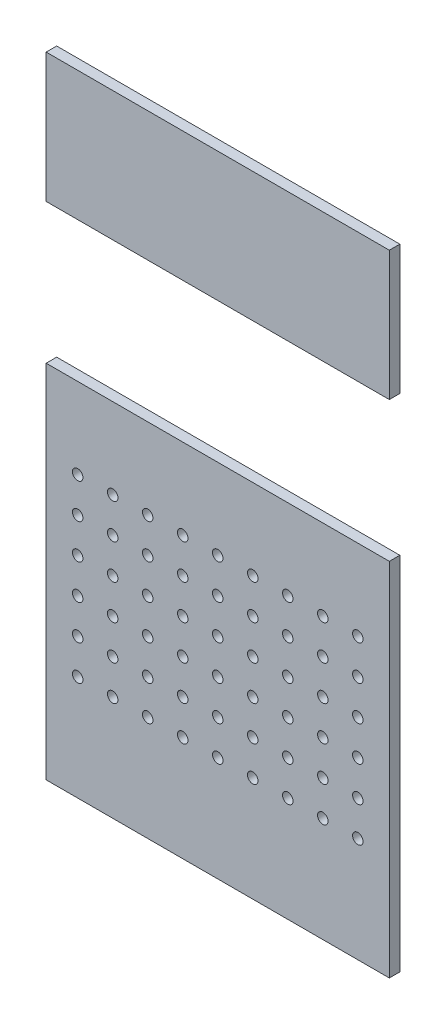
from build123d import *

# Parameters (mm, degrees)
CROQUIS1_W                = 98
CROQUIS1_H                = 103.054416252
CROQUIS1_R                = 1.5
SALIENTE_EXTRUIR2_DEPTH   = 3
CROQUIS1_H_2              = 36.945583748
SALIENTE_EXTRUIR2_2_DEPTH = 3


with BuildPart() as part:
    # Croquis1 → Saliente-Extruir2 (new body)
    with BuildSketch(Plane.XY):
        with Locations((25.551303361, -22.939606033)):
            Rectangle(CROQUIS1_W, CROQUIS1_H)
        with Locations((-14.448696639, -24.466814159)):
            Circle(CROQUIS1_R, mode=Mode.SUBTRACT)
        with Locations((-4.448696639, -24.466814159)):
            Circle(CROQUIS1_R, mode=Mode.SUBTRACT)
        with Locations((5.551303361, -24.466814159)):
            Circle(CROQUIS1_R, mode=Mode.SUBTRACT)
        with Locations((15.551303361, -24.466814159)):
            Circle(CROQUIS1_R, mode=Mode.SUBTRACT)
        with Locations((25.551303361, -24.466814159)):
            Circle(CROQUIS1_R, mode=Mode.SUBTRACT)
        with Locations((35.551303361, -24.466814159)):
            Circle(CROQUIS1_R, mode=Mode.SUBTRACT)
        with Locations((45.551303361, -24.466814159)):
            Circle(CROQUIS1_R, mode=Mode.SUBTRACT)
        with Locations((55.551303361, -24.466814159)):
            Circle(CROQUIS1_R, mode=Mode.SUBTRACT)
        with Locations((65.551303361, -24.466814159)):
            Circle(CROQUIS1_R, mode=Mode.SUBTRACT)
        with Locations((-4.448696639, -34.466814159)):
            Circle(CROQUIS1_R, mode=Mode.SUBTRACT)
        with Locations((5.551303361, -34.466814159)):
            Circle(CROQUIS1_R, mode=Mode.SUBTRACT)
        with Locations((15.551303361, -34.466814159)):
            Circle(CROQUIS1_R, mode=Mode.SUBTRACT)
        with Locations((25.551303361, -34.466814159)):
            Circle(CROQUIS1_R, mode=Mode.SUBTRACT)
        with Locations((35.551303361, -34.466814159)):
            Circle(CROQUIS1_R, mode=Mode.SUBTRACT)
        with Locations((45.551303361, -34.466814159)):
            Circle(CROQUIS1_R, mode=Mode.SUBTRACT)
        with Locations((55.551303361, -34.466814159)):
            Circle(CROQUIS1_R, mode=Mode.SUBTRACT)
        with Locations((65.551303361, -34.466814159)):
            Circle(CROQUIS1_R, mode=Mode.SUBTRACT)
        with Locations((-4.448696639, -44.466814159)):
            Circle(CROQUIS1_R, mode=Mode.SUBTRACT)
        with Locations((5.551303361, -44.466814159)):
            Circle(CROQUIS1_R, mode=Mode.SUBTRACT)
        with Locations((15.551303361, -44.466814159)):
            Circle(CROQUIS1_R, mode=Mode.SUBTRACT)
        with Locations((25.551303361, -44.466814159)):
            Circle(CROQUIS1_R, mode=Mode.SUBTRACT)
        with Locations((35.551303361, -44.466814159)):
            Circle(CROQUIS1_R, mode=Mode.SUBTRACT)
        with Locations((45.551303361, -44.466814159)):
            Circle(CROQUIS1_R, mode=Mode.SUBTRACT)
        with Locations((55.551303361, -44.466814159)):
            Circle(CROQUIS1_R, mode=Mode.SUBTRACT)
        with Locations((65.551303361, -44.466814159)):
            Circle(CROQUIS1_R, mode=Mode.SUBTRACT)
        with Locations((-14.448696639, -14.466814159)):
            Circle(CROQUIS1_R, mode=Mode.SUBTRACT)
        with Locations((-4.448696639, -14.466814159)):
            Circle(CROQUIS1_R, mode=Mode.SUBTRACT)
        with Locations((5.551303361, -14.466814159)):
            Circle(CROQUIS1_R, mode=Mode.SUBTRACT)
        with Locations((15.551303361, -14.466814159)):
            Circle(CROQUIS1_R, mode=Mode.SUBTRACT)
        with Locations((25.551303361, -14.466814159)):
            Circle(CROQUIS1_R, mode=Mode.SUBTRACT)
        with Locations((35.551303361, -14.466814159)):
            Circle(CROQUIS1_R, mode=Mode.SUBTRACT)
        with Locations((45.551303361, -14.466814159)):
            Circle(CROQUIS1_R, mode=Mode.SUBTRACT)
        with Locations((55.551303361, -14.466814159)):
            Circle(CROQUIS1_R, mode=Mode.SUBTRACT)
        with Locations((65.551303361, -14.466814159)):
            Circle(CROQUIS1_R, mode=Mode.SUBTRACT)
        with Locations((-4.448696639, -4.466814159)):
            Circle(CROQUIS1_R, mode=Mode.SUBTRACT)
        with Locations((5.551303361, -4.466814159)):
            Circle(CROQUIS1_R, mode=Mode.SUBTRACT)
        with Locations((15.551303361, -4.466814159)):
            Circle(CROQUIS1_R, mode=Mode.SUBTRACT)
        with Locations((25.551303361, -4.466814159)):
            Circle(CROQUIS1_R, mode=Mode.SUBTRACT)
        with Locations((35.551303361, -4.466814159)):
            Circle(CROQUIS1_R, mode=Mode.SUBTRACT)
        with Locations((45.551303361, -4.466814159)):
            Circle(CROQUIS1_R, mode=Mode.SUBTRACT)
        with Locations((55.551303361, -4.466814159)):
            Circle(CROQUIS1_R, mode=Mode.SUBTRACT)
        with Locations((-14.448696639, -34.466814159)):
            Circle(CROQUIS1_R, mode=Mode.SUBTRACT)
        with Locations((-14.448696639, -44.466814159)):
            Circle(CROQUIS1_R, mode=Mode.SUBTRACT)
        with Locations((65.551303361, -4.466814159)):
            Circle(CROQUIS1_R, mode=Mode.SUBTRACT)
        with Locations((-4.448696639, 5.533185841)):
            Circle(CROQUIS1_R, mode=Mode.SUBTRACT)
        with Locations((5.551303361, 5.533185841)):
            Circle(CROQUIS1_R, mode=Mode.SUBTRACT)
        with Locations((15.551303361, 5.533185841)):
            Circle(CROQUIS1_R, mode=Mode.SUBTRACT)
        with Locations((25.551303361, 5.533185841)):
            Circle(CROQUIS1_R, mode=Mode.SUBTRACT)
        with Locations((35.551303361, 5.533185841)):
            Circle(CROQUIS1_R, mode=Mode.SUBTRACT)
        with Locations((45.551303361, 5.533185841)):
            Circle(CROQUIS1_R, mode=Mode.SUBTRACT)
        with Locations((55.551303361, 5.533185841)):
            Circle(CROQUIS1_R, mode=Mode.SUBTRACT)
        with Locations((65.551303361, 5.533185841)):
            Circle(CROQUIS1_R, mode=Mode.SUBTRACT)
        with Locations((-14.448696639, -4.466814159)):
            Circle(CROQUIS1_R, mode=Mode.SUBTRACT)
        with Locations((-14.448696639, 5.533185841)):
            Circle(CROQUIS1_R, mode=Mode.SUBTRACT)
    extrude(amount=SALIENTE_EXTRUIR2_DEPTH)


with BuildPart() as body_2:
    # Croquis1 → Saliente-Extruir2 2 (new body)
    with BuildSketch(Plane.XY):
        with Locations((25.551303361, 87.060393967)):
            Rectangle(CROQUIS1_W, CROQUIS1_H_2)
    extrude(amount=SALIENTE_EXTRUIR2_2_DEPTH)


solid = Compound([part.part, body_2.part])
